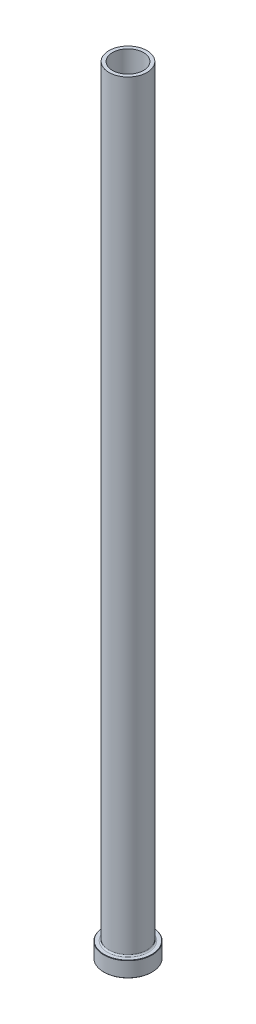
from build123d import *

# Parameters (mm, degrees)
FILLET1_R     = 0.8
CHAMFER1_SIZE = 0.2
CHAMFER3_SIZE = 0.5


with BuildPart() as part:
    # Sketch1 → Revolve1 (revolve)
    with BuildSketch(Plane.XY, mode=Mode.PRIVATE) as revolve1_sk:
        Polygon((-9, 450), (-11, 450), (-11, 9), (-14, 9), (-14, 0), (-9.25, 0), (-9.25, 383), (-9, 395), align=None)
    revolve(revolve1_sk.sketch.rotate(Axis((0, 92.187680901, 0), (0, -1, 0)), 270), axis=Axis((0, 92.187680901, 0), (0, -1, 0)))

    # Fillet1
    fillet1_edges = [part.edges().sort_by_distance(p)[0] for p in [
        (0, 9, -11),
    ]]
    fillet(fillet1_edges, radius=FILLET1_R)

    # Chamfer1
    chamfer1_edges = [part.edges().sort_by_distance(p)[0] for p in [
        (0, 0, -14),
        (0, 9, -14),
    ]]
    chamfer(chamfer1_edges, length=CHAMFER1_SIZE)

    # Chamfer3
    chamfer3_edges = [part.edges().sort_by_distance(p)[0] for p in [
        (0, 0, -9.25),
    ]]
    chamfer(chamfer3_edges, length=CHAMFER3_SIZE)


solid = part.part
